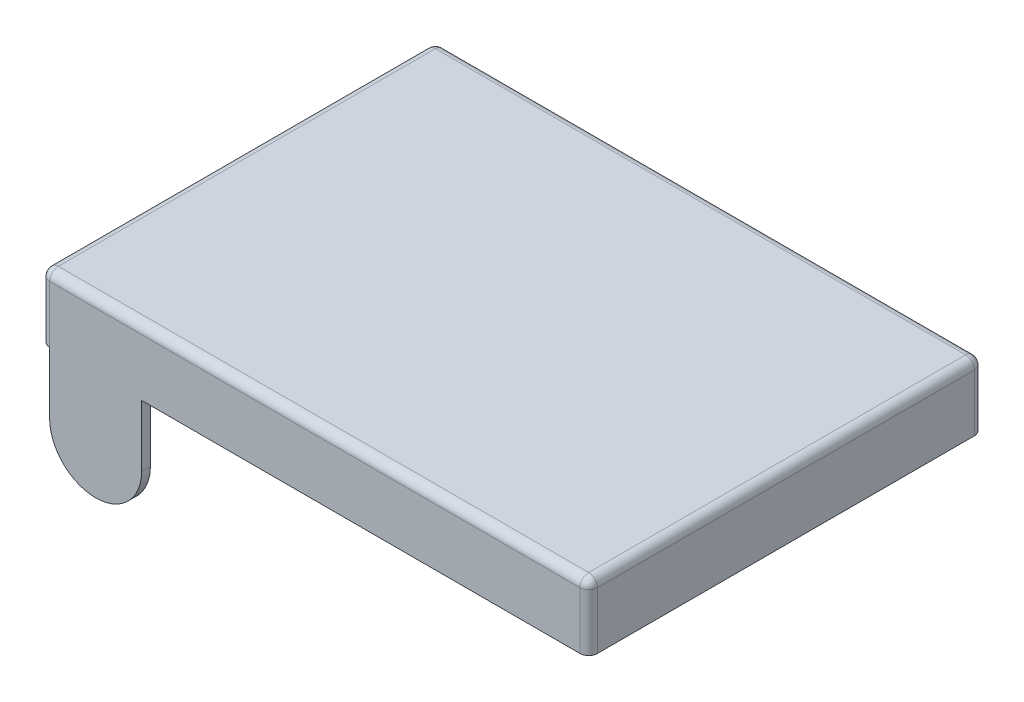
ISO-10303-21;
HEADER;
FILE_DESCRIPTION(('STEP AP214'),'2;1');
FILE_NAME('part.step','',(''),(''),'','','');
FILE_SCHEMA(('AUTOMOTIVE_DESIGN { 1 0 10303 214 1 1 1 1 }'));
ENDSEC;
DATA;
#1=APPLICATION_CONTEXT('core data for automotive mechanical design processes');
#2=APPLICATION_PROTOCOL_DEFINITION('international standard','automotive_design',2000,#1);
#3=PRODUCT_CONTEXT('',#1,'mechanical');
#4=PRODUCT('Part','Part','',(#3));
#5=PRODUCT_RELATED_PRODUCT_CATEGORY('part','',(#4));
#6=PRODUCT_DEFINITION_FORMATION('','',#4);
#7=PRODUCT_DEFINITION_CONTEXT('part definition',#1,'design');
#8=PRODUCT_DEFINITION('design','',#6,#7);
#9=PRODUCT_DEFINITION_SHAPE('','',#8);
#10=(LENGTH_UNIT() NAMED_UNIT(*) SI_UNIT(.MILLI.,.METRE.));
#11=(NAMED_UNIT(*) PLANE_ANGLE_UNIT() SI_UNIT($,.RADIAN.));
#12=(NAMED_UNIT(*) SI_UNIT($,.STERADIAN.) SOLID_ANGLE_UNIT());
#13=UNCERTAINTY_MEASURE_WITH_UNIT(LENGTH_MEASURE(1.E-05),#10,'distance_accuracy_value','');
#14=(GEOMETRIC_REPRESENTATION_CONTEXT(3) GLOBAL_UNCERTAINTY_ASSIGNED_CONTEXT((#13)) GLOBAL_UNIT_ASSIGNED_CONTEXT((#10,
#11,#12)) REPRESENTATION_CONTEXT('',''));
#15=CARTESIAN_POINT('',(0.,0.,0.));
#16=DIRECTION('',(0.,0.,1.));
#17=DIRECTION('',(1.,0.,0.));
#18=AXIS2_PLACEMENT_3D('',#15,#16,#17);
#19=CARTESIAN_POINT('',(62.5,0.,-45.));
#20=DIRECTION('',(0.,1.,0.));
#21=DIRECTION('',(0.,0.,1.));
#22=AXIS2_PLACEMENT_3D('',#19,#20,#21);
#23=PLANE('',#22);
#24=DIRECTION('',(0.,0.,-1.));
#25=VECTOR('',#24,1.);
#26=CARTESIAN_POINT('',(-60.5,0.,-43.));
#27=LINE('',#26,#25);
#28=CARTESIAN_POINT('',(-60.5,0.,-43.));
#29=VERTEX_POINT('',#28);
#30=CARTESIAN_POINT('',(-60.5,0.,-45.));
#31=VERTEX_POINT('',#30);
#32=EDGE_CURVE('E206',#29,#31,#27,.T.);
#33=ORIENTED_EDGE('',*,*,#32,.F.);
#34=DIRECTION('',(0.,0.,1.));
#35=VECTOR('',#34,1.);
#36=CARTESIAN_POINT('',(-60.5,0.,45.));
#37=LINE('',#36,#35);
#38=CARTESIAN_POINT('',(-60.5,0.,43.));
#39=VERTEX_POINT('',#38);
#40=EDGE_CURVE('E326',#29,#39,#37,.T.);
#41=ORIENTED_EDGE('',*,*,#40,.T.);
#42=DIRECTION('',(0.,0.,1.));
#43=VECTOR('',#42,1.);
#44=CARTESIAN_POINT('',(-60.5,0.,43.));
#45=LINE('',#44,#43);
#46=CARTESIAN_POINT('',(-60.5,0.,45.));
#47=VERTEX_POINT('',#46);
#48=EDGE_CURVE('E243',#39,#47,#45,.T.);
#49=ORIENTED_EDGE('',*,*,#48,.T.);
#50=CARTESIAN_POINT('',(-60.5,0.,43.));
#51=DIRECTION('',(0.,1.,0.));
#52=DIRECTION('',(0.,0.,1.));
#53=AXIS2_PLACEMENT_3D('',#50,#51,#52);
#54=CIRCLE('',#53,2.);
#55=CARTESIAN_POINT('',(-62.5,0.,43.));
#56=VERTEX_POINT('',#55);
#57=EDGE_CURVE('E283',#47,#56,#54,.F.);
#58=ORIENTED_EDGE('',*,*,#57,.T.);
#59=DIRECTION('',(0.,0.,1.));
#60=VECTOR('',#59,1.);
#61=CARTESIAN_POINT('',(-62.5,0.,45.));
#62=LINE('',#61,#60);
#63=CARTESIAN_POINT('',(-62.5,0.,-43.));
#64=VERTEX_POINT('',#63);
#65=EDGE_CURVE('E262',#64,#56,#62,.T.);
#66=ORIENTED_EDGE('',*,*,#65,.F.);
#67=CARTESIAN_POINT('',(-60.5,0.,-43.));
#68=DIRECTION('',(0.,1.,0.));
#69=DIRECTION('',(0.,0.,1.));
#70=AXIS2_PLACEMENT_3D('',#67,#68,#69);
#71=CIRCLE('',#70,2.);
#72=EDGE_CURVE('E285',#64,#31,#71,.F.);
#73=ORIENTED_EDGE('',*,*,#72,.T.);
#74=EDGE_LOOP('',(#33,#41,#49,#58,#66,#73));
#75=FACE_BOUND('',#74,.T.);
#76=ADVANCED_FACE('F32',(#75),#23,.F.);
#77=DIRECTION('',(0.,0.,-1.));
#78=VECTOR('',#77,1.);
#79=CARTESIAN_POINT('',(-39.5,0.,-43.));
#80=LINE('',#79,#78);
#81=CARTESIAN_POINT('',(-39.5,0.,-43.));
#82=VERTEX_POINT('',#81);
#83=CARTESIAN_POINT('',(-39.5,0.,-45.));
#84=VERTEX_POINT('',#83);
#85=EDGE_CURVE('E49',#82,#84,#80,.T.);
#86=ORIENTED_EDGE('',*,*,#85,.T.);
#87=DIRECTION('',(-1.,0.,0.));
#88=VECTOR('',#87,1.);
#89=CARTESIAN_POINT('',(-62.5,0.,-45.));
#90=LINE('',#89,#88);
#91=CARTESIAN_POINT('',(60.5,0.,-45.));
#92=VERTEX_POINT('',#91);
#93=EDGE_CURVE('E192',#92,#84,#90,.T.);
#94=ORIENTED_EDGE('',*,*,#93,.F.);
#95=CARTESIAN_POINT('',(60.5,0.,-43.));
#96=DIRECTION('',(0.,1.,0.));
#97=DIRECTION('',(0.,0.,1.));
#98=AXIS2_PLACEMENT_3D('',#95,#96,#97);
#99=CIRCLE('',#98,2.);
#100=CARTESIAN_POINT('',(62.5,0.,-43.));
#101=VERTEX_POINT('',#100);
#102=EDGE_CURVE('E281',#92,#101,#99,.F.);
#103=ORIENTED_EDGE('',*,*,#102,.T.);
#104=DIRECTION('',(0.,0.,-1.));
#105=VECTOR('',#104,1.);
#106=CARTESIAN_POINT('',(62.5,0.,45.));
#107=LINE('',#106,#105);
#108=CARTESIAN_POINT('',(62.5,0.,43.));
#109=VERTEX_POINT('',#108);
#110=EDGE_CURVE('E261',#109,#101,#107,.T.);
#111=ORIENTED_EDGE('',*,*,#110,.F.);
#112=CARTESIAN_POINT('',(60.5,0.,43.));
#113=DIRECTION('',(0.,1.,0.));
#114=DIRECTION('',(0.,0.,1.));
#115=AXIS2_PLACEMENT_3D('',#112,#113,#114);
#116=CIRCLE('',#115,2.);
#117=CARTESIAN_POINT('',(60.5,0.,45.));
#118=VERTEX_POINT('',#117);
#119=EDGE_CURVE('E259',#109,#118,#116,.F.);
#120=ORIENTED_EDGE('',*,*,#119,.T.);
#121=DIRECTION('',(1.,0.,0.));
#122=VECTOR('',#121,1.);
#123=CARTESIAN_POINT('',(-62.5,0.,45.));
#124=LINE('',#123,#122);
#125=CARTESIAN_POINT('',(-39.5,0.,45.));
#126=VERTEX_POINT('',#125);
#127=EDGE_CURVE('E239',#126,#118,#124,.T.);
#128=ORIENTED_EDGE('',*,*,#127,.F.);
#129=DIRECTION('',(0.,0.,1.));
#130=VECTOR('',#129,1.);
#131=CARTESIAN_POINT('',(-39.5,0.,43.));
#132=LINE('',#131,#130);
#133=CARTESIAN_POINT('',(-39.5,0.,43.));
#134=VERTEX_POINT('',#133);
#135=EDGE_CURVE('E236',#134,#126,#132,.T.);
#136=ORIENTED_EDGE('',*,*,#135,.F.);
#137=DIRECTION('',(1.,0.,0.));
#138=VECTOR('',#137,1.);
#139=CARTESIAN_POINT('',(-62.5,0.,43.));
#140=LINE('',#139,#138);
#141=CARTESIAN_POINT('',(60.5,0.,43.));
#142=VERTEX_POINT('',#141);
#143=EDGE_CURVE('E323',#134,#142,#140,.T.);
#144=ORIENTED_EDGE('',*,*,#143,.T.);
#145=DIRECTION('',(0.,0.,-1.));
#146=VECTOR('',#145,1.);
#147=CARTESIAN_POINT('',(60.5,0.,45.));
#148=LINE('',#147,#146);
#149=CARTESIAN_POINT('',(60.5,0.,-43.));
#150=VERTEX_POINT('',#149);
#151=EDGE_CURVE('E325',#142,#150,#148,.T.);
#152=ORIENTED_EDGE('',*,*,#151,.T.);
#153=DIRECTION('',(-1.,0.,0.));
#154=VECTOR('',#153,1.);
#155=CARTESIAN_POINT('',(-62.5,0.,-43.));
#156=LINE('',#155,#154);
#157=EDGE_CURVE('E54',#150,#82,#156,.T.);
#158=ORIENTED_EDGE('',*,*,#157,.T.);
#159=EDGE_LOOP('',(#86,#94,#103,#111,#120,#128,#136,#144,#152,#158));
#160=FACE_BOUND('',#159,.T.);
#161=ADVANCED_FACE('F255',(#160),#23,.F.);
#162=CARTESIAN_POINT('',(-62.5,15.,-45.));
#163=DIRECTION('',(0.,0.,1.));
#164=DIRECTION('',(1.,0.,0.));
#165=AXIS2_PLACEMENT_3D('',#162,#163,#164);
#166=PLANE('',#165);
#167=DIRECTION('',(0.,-1.,0.));
#168=VECTOR('',#167,1.);
#169=CARTESIAN_POINT('',(-60.5,15.,-45.));
#170=LINE('',#169,#168);
#171=CARTESIAN_POINT('',(-60.5,13.,-45.));
#172=VERTEX_POINT('',#171);
#173=EDGE_CURVE('E289',#31,#172,#170,.F.);
#174=ORIENTED_EDGE('',*,*,#173,.T.);
#175=DIRECTION('',(-1.,0.,0.));
#176=VECTOR('',#175,1.);
#177=CARTESIAN_POINT('',(60.5,13.,-45.));
#178=LINE('',#177,#176);
#179=CARTESIAN_POINT('',(60.5,13.,-45.));
#180=VERTEX_POINT('',#179);
#181=EDGE_CURVE('E317',#172,#180,#178,.F.);
#182=ORIENTED_EDGE('',*,*,#181,.T.);
#183=DIRECTION('',(0.,-1.,0.));
#184=VECTOR('',#183,1.);
#185=CARTESIAN_POINT('',(60.5,15.,-45.));
#186=LINE('',#185,#184);
#187=EDGE_CURVE('E287',#180,#92,#186,.T.);
#188=ORIENTED_EDGE('',*,*,#187,.T.);
#189=ORIENTED_EDGE('',*,*,#93,.T.);
#190=DIRECTION('',(0.,1.,0.));
#191=VECTOR('',#190,1.);
#192=CARTESIAN_POINT('',(-39.5,-14.,-45.));
#193=LINE('',#192,#191);
#194=CARTESIAN_POINT('',(-39.5,-14.,-45.));
#195=VERTEX_POINT('',#194);
#196=EDGE_CURVE('E184',#195,#84,#193,.T.);
#197=ORIENTED_EDGE('',*,*,#196,.F.);
#198=CARTESIAN_POINT('',(-50.,-14.,-45.));
#199=DIRECTION('',(0.,0.,1.));
#200=DIRECTION('',(1.,0.,0.));
#201=AXIS2_PLACEMENT_3D('',#198,#199,#200);
#202=CIRCLE('',#201,10.5);
#203=CARTESIAN_POINT('',(-60.5,-14.,-45.));
#204=VERTEX_POINT('',#203);
#205=EDGE_CURVE('E172',#204,#195,#202,.T.);
#206=ORIENTED_EDGE('',*,*,#205,.F.);
#207=DIRECTION('',(0.,-1.,0.));
#208=VECTOR('',#207,1.);
#209=CARTESIAN_POINT('',(-60.5,0.,-45.));
#210=LINE('',#209,#208);
#211=EDGE_CURVE('E183',#31,#204,#210,.T.);
#212=ORIENTED_EDGE('',*,*,#211,.F.);
#213=EDGE_LOOP('',(#174,#182,#188,#189,#197,#206,#212));
#214=FACE_BOUND('',#213,.T.);
#215=ADVANCED_FACE('F34',(#214),#166,.F.);
#216=CARTESIAN_POINT('',(-62.5,15.,45.));
#217=DIRECTION('',(1.,0.,0.));
#218=DIRECTION('',(0.,0.,-1.));
#219=AXIS2_PLACEMENT_3D('',#216,#217,#218);
#220=PLANE('',#219);
#221=DIRECTION('',(0.,-1.,0.));
#222=VECTOR('',#221,1.);
#223=CARTESIAN_POINT('',(-62.5,15.,43.));
#224=LINE('',#223,#222);
#225=CARTESIAN_POINT('',(-62.5,13.,43.));
#226=VERTEX_POINT('',#225);
#227=EDGE_CURVE('E264',#56,#226,#224,.F.);
#228=ORIENTED_EDGE('',*,*,#227,.T.);
#229=DIRECTION('',(0.,0.,1.));
#230=VECTOR('',#229,1.);
#231=CARTESIAN_POINT('',(-62.5,13.,-43.));
#232=LINE('',#231,#230);
#233=CARTESIAN_POINT('',(-62.5,13.,-43.));
#234=VERTEX_POINT('',#233);
#235=EDGE_CURVE('E313',#226,#234,#232,.F.);
#236=ORIENTED_EDGE('',*,*,#235,.T.);
#237=DIRECTION('',(0.,-1.,0.));
#238=VECTOR('',#237,1.);
#239=CARTESIAN_POINT('',(-62.5,15.,-43.));
#240=LINE('',#239,#238);
#241=EDGE_CURVE('E278',#234,#64,#240,.T.);
#242=ORIENTED_EDGE('',*,*,#241,.T.);
#243=ORIENTED_EDGE('',*,*,#65,.T.);
#244=EDGE_LOOP('',(#228,#236,#242,#243));
#245=FACE_BOUND('',#244,.T.);
#246=ADVANCED_FACE('F398',(#245),#220,.F.);
#247=CARTESIAN_POINT('',(-62.5,15.,45.));
#248=DIRECTION('',(0.,0.,-1.));
#249=DIRECTION('',(-1.,0.,0.));
#250=AXIS2_PLACEMENT_3D('',#247,#248,#249);
#251=PLANE('',#250);
#252=DIRECTION('',(0.,-1.,0.));
#253=VECTOR('',#252,1.);
#254=CARTESIAN_POINT('',(60.5,15.,45.));
#255=LINE('',#254,#253);
#256=CARTESIAN_POINT('',(60.5,13.,45.));
#257=VERTEX_POINT('',#256);
#258=EDGE_CURVE('E291',#118,#257,#255,.F.);
#259=ORIENTED_EDGE('',*,*,#258,.T.);
#260=DIRECTION('',(1.,0.,0.));
#261=VECTOR('',#260,1.);
#262=CARTESIAN_POINT('',(-60.5,13.,45.));
#263=LINE('',#262,#261);
#264=CARTESIAN_POINT('',(-60.5,13.,45.));
#265=VERTEX_POINT('',#264);
#266=EDGE_CURVE('E11',#257,#265,#263,.F.);
#267=ORIENTED_EDGE('',*,*,#266,.T.);
#268=DIRECTION('',(0.,-1.,0.));
#269=VECTOR('',#268,1.);
#270=CARTESIAN_POINT('',(-60.5,15.,45.));
#271=LINE('',#270,#269);
#272=EDGE_CURVE('E293',#265,#47,#271,.T.);
#273=ORIENTED_EDGE('',*,*,#272,.T.);
#274=DIRECTION('',(0.,-1.,0.));
#275=VECTOR('',#274,1.);
#276=CARTESIAN_POINT('',(-60.5,0.,45.));
#277=LINE('',#276,#275);
#278=CARTESIAN_POINT('',(-60.5,-14.,45.));
#279=VERTEX_POINT('',#278);
#280=EDGE_CURVE('E217',#47,#279,#277,.T.);
#281=ORIENTED_EDGE('',*,*,#280,.T.);
#282=CARTESIAN_POINT('',(-50.,-14.,45.));
#283=DIRECTION('',(0.,0.,1.));
#284=DIRECTION('',(1.,0.,0.));
#285=AXIS2_PLACEMENT_3D('',#282,#283,#284);
#286=CIRCLE('',#285,10.5);
#287=CARTESIAN_POINT('',(-39.5,-14.,45.));
#288=VERTEX_POINT('',#287);
#289=EDGE_CURVE('E220',#279,#288,#286,.T.);
#290=ORIENTED_EDGE('',*,*,#289,.T.);
#291=DIRECTION('',(0.,1.,0.));
#292=VECTOR('',#291,1.);
#293=CARTESIAN_POINT('',(-39.5,-14.,45.));
#294=LINE('',#293,#292);
#295=EDGE_CURVE('E223',#288,#126,#294,.T.);
#296=ORIENTED_EDGE('',*,*,#295,.T.);
#297=ORIENTED_EDGE('',*,*,#127,.T.);
#298=EDGE_LOOP('',(#259,#267,#273,#281,#290,#296,#297));
#299=FACE_BOUND('',#298,.T.);
#300=ADVANCED_FACE('F250',(#299),#251,.F.);
#301=CARTESIAN_POINT('',(62.5,15.,45.));
#302=DIRECTION('',(-1.,0.,0.));
#303=DIRECTION('',(0.,0.,1.));
#304=AXIS2_PLACEMENT_3D('',#301,#302,#303);
#305=PLANE('',#304);
#306=DIRECTION('',(0.,-1.,0.));
#307=VECTOR('',#306,1.);
#308=CARTESIAN_POINT('',(62.5,15.,-43.));
#309=LINE('',#308,#307);
#310=CARTESIAN_POINT('',(62.5,13.,-43.));
#311=VERTEX_POINT('',#310);
#312=EDGE_CURVE('E298',#101,#311,#309,.F.);
#313=ORIENTED_EDGE('',*,*,#312,.T.);
#314=DIRECTION('',(0.,0.,-1.));
#315=VECTOR('',#314,1.);
#316=CARTESIAN_POINT('',(62.5,13.,43.));
#317=LINE('',#316,#315);
#318=CARTESIAN_POINT('',(62.5,13.,43.));
#319=VERTEX_POINT('',#318);
#320=EDGE_CURVE('E321',#311,#319,#317,.F.);
#321=ORIENTED_EDGE('',*,*,#320,.T.);
#322=DIRECTION('',(0.,-1.,0.));
#323=VECTOR('',#322,1.);
#324=CARTESIAN_POINT('',(62.5,15.,43.));
#325=LINE('',#324,#323);
#326=EDGE_CURVE('E296',#319,#109,#325,.T.);
#327=ORIENTED_EDGE('',*,*,#326,.T.);
#328=ORIENTED_EDGE('',*,*,#110,.T.);
#329=EDGE_LOOP('',(#313,#321,#327,#328));
#330=FACE_BOUND('',#329,.T.);
#331=ADVANCED_FACE('F370',(#330),#305,.F.);
#332=CARTESIAN_POINT('',(62.5,15.,-45.));
#333=DIRECTION('',(0.,1.,0.));
#334=DIRECTION('',(0.,0.,1.));
#335=AXIS2_PLACEMENT_3D('',#332,#333,#334);
#336=PLANE('',#335);
#337=DIRECTION('',(-1.,0.,0.));
#338=VECTOR('',#337,1.);
#339=CARTESIAN_POINT('',(-60.5,15.,-43.));
#340=LINE('',#339,#338);
#341=CARTESIAN_POINT('',(60.5,15.,-43.));
#342=VERTEX_POINT('',#341);
#343=CARTESIAN_POINT('',(-60.5,15.,-43.));
#344=VERTEX_POINT('',#343);
#345=EDGE_CURVE('E308',#342,#344,#340,.T.);
#346=ORIENTED_EDGE('',*,*,#345,.T.);
#347=DIRECTION('',(0.,0.,1.));
#348=VECTOR('',#347,1.);
#349=CARTESIAN_POINT('',(-60.5,15.,43.));
#350=LINE('',#349,#348);
#351=CARTESIAN_POINT('',(-60.5,15.,43.));
#352=VERTEX_POINT('',#351);
#353=EDGE_CURVE('E310',#344,#352,#350,.T.);
#354=ORIENTED_EDGE('',*,*,#353,.T.);
#355=DIRECTION('',(1.,0.,0.));
#356=VECTOR('',#355,1.);
#357=CARTESIAN_POINT('',(60.5,15.,43.));
#358=LINE('',#357,#356);
#359=CARTESIAN_POINT('',(60.5,15.,43.));
#360=VERTEX_POINT('',#359);
#361=EDGE_CURVE('E304',#352,#360,#358,.T.);
#362=ORIENTED_EDGE('',*,*,#361,.T.);
#363=DIRECTION('',(0.,0.,-1.));
#364=VECTOR('',#363,1.);
#365=CARTESIAN_POINT('',(60.5,15.,-43.));
#366=LINE('',#365,#364);
#367=EDGE_CURVE('E306',#360,#342,#366,.T.);
#368=ORIENTED_EDGE('',*,*,#367,.T.);
#369=EDGE_LOOP('',(#346,#354,#362,#368));
#370=FACE_BOUND('',#369,.T.);
#371=ADVANCED_FACE('F416',(#370),#336,.T.);
#372=CARTESIAN_POINT('',(-60.5,15.,-43.));
#373=DIRECTION('',(0.,-1.,0.));
#374=DIRECTION('',(0.,0.,-1.));
#375=AXIS2_PLACEMENT_3D('',#372,#373,#374);
#376=CYLINDRICAL_SURFACE('',#375,2.);
#377=ORIENTED_EDGE('',*,*,#241,.F.);
#378=CARTESIAN_POINT('',(-60.5,13.,-43.));
#379=DIRECTION('',(0.,-1.,0.));
#380=DIRECTION('',(0.,0.,-1.));
#381=AXIS2_PLACEMENT_3D('',#378,#379,#380);
#382=CIRCLE('',#381,2.);
#383=EDGE_CURVE('E315',#234,#172,#382,.T.);
#384=ORIENTED_EDGE('',*,*,#383,.T.);
#385=ORIENTED_EDGE('',*,*,#173,.F.);
#386=ORIENTED_EDGE('',*,*,#72,.F.);
#387=EDGE_LOOP('',(#377,#384,#385,#386));
#388=FACE_BOUND('',#387,.T.);
#389=ADVANCED_FACE('F414',(#388),#376,.T.);
#390=CARTESIAN_POINT('',(-60.5,15.,43.));
#391=DIRECTION('',(0.,-1.,0.));
#392=DIRECTION('',(0.,0.,-1.));
#393=AXIS2_PLACEMENT_3D('',#390,#391,#392);
#394=CYLINDRICAL_SURFACE('',#393,2.);
#395=ORIENTED_EDGE('',*,*,#272,.F.);
#396=CARTESIAN_POINT('',(-60.5,13.,43.));
#397=DIRECTION('',(0.,-1.,0.));
#398=DIRECTION('',(0.,0.,-1.));
#399=AXIS2_PLACEMENT_3D('',#396,#397,#398);
#400=CIRCLE('',#399,2.);
#401=EDGE_CURVE('E301',#265,#226,#400,.T.);
#402=ORIENTED_EDGE('',*,*,#401,.T.);
#403=ORIENTED_EDGE('',*,*,#227,.F.);
#404=ORIENTED_EDGE('',*,*,#57,.F.);
#405=EDGE_LOOP('',(#395,#402,#403,#404));
#406=FACE_BOUND('',#405,.T.);
#407=ADVANCED_FACE('F396',(#406),#394,.T.);
#408=CARTESIAN_POINT('',(60.5,15.,-43.));
#409=DIRECTION('',(0.,-1.,0.));
#410=DIRECTION('',(0.,0.,-1.));
#411=AXIS2_PLACEMENT_3D('',#408,#409,#410);
#412=CYLINDRICAL_SURFACE('',#411,2.);
#413=ORIENTED_EDGE('',*,*,#187,.F.);
#414=CARTESIAN_POINT('',(60.5,13.,-43.));
#415=DIRECTION('',(0.,-1.,0.));
#416=DIRECTION('',(0.,0.,-1.));
#417=AXIS2_PLACEMENT_3D('',#414,#415,#416);
#418=CIRCLE('',#417,2.);
#419=EDGE_CURVE('E319',#180,#311,#418,.T.);
#420=ORIENTED_EDGE('',*,*,#419,.T.);
#421=ORIENTED_EDGE('',*,*,#312,.F.);
#422=ORIENTED_EDGE('',*,*,#102,.F.);
#423=EDGE_LOOP('',(#413,#420,#421,#422));
#424=FACE_BOUND('',#423,.T.);
#425=ADVANCED_FACE('F367',(#424),#412,.T.);
#426=CARTESIAN_POINT('',(60.5,15.,43.));
#427=DIRECTION('',(0.,-1.,0.));
#428=DIRECTION('',(0.,0.,-1.));
#429=AXIS2_PLACEMENT_3D('',#426,#427,#428);
#430=CYLINDRICAL_SURFACE('',#429,2.);
#431=ORIENTED_EDGE('',*,*,#326,.F.);
#432=CARTESIAN_POINT('',(60.5,13.,43.));
#433=DIRECTION('',(0.,-1.,0.));
#434=DIRECTION('',(0.,0.,-1.));
#435=AXIS2_PLACEMENT_3D('',#432,#433,#434);
#436=CIRCLE('',#435,2.);
#437=EDGE_CURVE('E41',#319,#257,#436,.T.);
#438=ORIENTED_EDGE('',*,*,#437,.T.);
#439=ORIENTED_EDGE('',*,*,#258,.F.);
#440=ORIENTED_EDGE('',*,*,#119,.F.);
#441=EDGE_LOOP('',(#431,#438,#439,#440));
#442=FACE_BOUND('',#441,.T.);
#443=ADVANCED_FACE('F374',(#442),#430,.T.);
#444=CARTESIAN_POINT('',(60.5,13.,-43.));
#445=DIRECTION('',(0.,0.,1.));
#446=DIRECTION('',(1.,0.,0.));
#447=AXIS2_PLACEMENT_3D('',#444,#445,#446);
#448=SPHERICAL_SURFACE('',#447,2.);
#449=CARTESIAN_POINT('',(60.5,13.,-43.));
#450=DIRECTION('',(0.,0.,1.));
#451=DIRECTION('',(1.,0.,0.));
#452=AXIS2_PLACEMENT_3D('',#449,#450,#451);
#453=CIRCLE('',#452,2.);
#454=EDGE_CURVE('E350',#311,#342,#453,.T.);
#455=ORIENTED_EDGE('',*,*,#454,.F.);
#456=ORIENTED_EDGE('',*,*,#419,.F.);
#457=CARTESIAN_POINT('',(60.5,13.,-43.));
#458=DIRECTION('',(-1.,0.,0.));
#459=DIRECTION('',(0.,0.,1.));
#460=AXIS2_PLACEMENT_3D('',#457,#458,#459);
#461=CIRCLE('',#460,2.);
#462=EDGE_CURVE('E272',#342,#180,#461,.T.);
#463=ORIENTED_EDGE('',*,*,#462,.F.);
#464=EDGE_LOOP('',(#455,#456,#463));
#465=FACE_BOUND('',#464,.T.);
#466=ADVANCED_FACE('F362',(#465),#448,.T.);
#467=CARTESIAN_POINT('',(62.5,13.,-43.));
#468=DIRECTION('',(1.,0.,0.));
#469=DIRECTION('',(0.,0.,-1.));
#470=AXIS2_PLACEMENT_3D('',#467,#468,#469);
#471=CYLINDRICAL_SURFACE('',#470,2.);
#472=ORIENTED_EDGE('',*,*,#462,.T.);
#473=ORIENTED_EDGE('',*,*,#181,.F.);
#474=CARTESIAN_POINT('',(-60.5,13.,-43.));
#475=DIRECTION('',(-1.,0.,0.));
#476=DIRECTION('',(0.,0.,1.));
#477=AXIS2_PLACEMENT_3D('',#474,#475,#476);
#478=CIRCLE('',#477,2.);
#479=EDGE_CURVE('E347',#344,#172,#478,.T.);
#480=ORIENTED_EDGE('',*,*,#479,.F.);
#481=ORIENTED_EDGE('',*,*,#345,.F.);
#482=EDGE_LOOP('',(#472,#473,#480,#481));
#483=FACE_BOUND('',#482,.T.);
#484=ADVANCED_FACE('F357',(#483),#471,.T.);
#485=CARTESIAN_POINT('',(60.5,13.,-45.));
#486=DIRECTION('',(0.,0.,1.));
#487=DIRECTION('',(1.,0.,0.));
#488=AXIS2_PLACEMENT_3D('',#485,#486,#487);
#489=CYLINDRICAL_SURFACE('',#488,2.);
#490=ORIENTED_EDGE('',*,*,#454,.T.);
#491=ORIENTED_EDGE('',*,*,#367,.F.);
#492=CARTESIAN_POINT('',(60.5,13.,43.));
#493=DIRECTION('',(0.,0.,1.));
#494=DIRECTION('',(1.,0.,0.));
#495=AXIS2_PLACEMENT_3D('',#492,#493,#494);
#496=CIRCLE('',#495,2.);
#497=EDGE_CURVE('E344',#319,#360,#496,.T.);
#498=ORIENTED_EDGE('',*,*,#497,.F.);
#499=ORIENTED_EDGE('',*,*,#320,.F.);
#500=EDGE_LOOP('',(#490,#491,#498,#499));
#501=FACE_BOUND('',#500,.T.);
#502=ADVANCED_FACE('F467',(#501),#489,.T.);
#503=CARTESIAN_POINT('',(-60.5,13.,-43.));
#504=DIRECTION('',(0.,0.,1.));
#505=DIRECTION('',(1.,0.,0.));
#506=AXIS2_PLACEMENT_3D('',#503,#504,#505);
#507=SPHERICAL_SURFACE('',#506,2.);
#508=ORIENTED_EDGE('',*,*,#479,.T.);
#509=ORIENTED_EDGE('',*,*,#383,.F.);
#510=CARTESIAN_POINT('',(-60.5,13.,-43.));
#511=DIRECTION('',(0.,0.,1.));
#512=DIRECTION('',(1.,0.,0.));
#513=AXIS2_PLACEMENT_3D('',#510,#511,#512);
#514=CIRCLE('',#513,2.);
#515=EDGE_CURVE('E341',#344,#234,#514,.T.);
#516=ORIENTED_EDGE('',*,*,#515,.F.);
#517=EDGE_LOOP('',(#508,#509,#516));
#518=FACE_BOUND('',#517,.T.);
#519=ADVANCED_FACE('F474',(#518),#507,.T.);
#520=CARTESIAN_POINT('',(60.5,13.,43.));
#521=DIRECTION('',(0.,0.,1.));
#522=DIRECTION('',(1.,0.,0.));
#523=AXIS2_PLACEMENT_3D('',#520,#521,#522);
#524=SPHERICAL_SURFACE('',#523,2.);
#525=ORIENTED_EDGE('',*,*,#437,.F.);
#526=ORIENTED_EDGE('',*,*,#497,.T.);
#527=CARTESIAN_POINT('',(60.5,13.,43.));
#528=DIRECTION('',(-1.,0.,0.));
#529=DIRECTION('',(0.,0.,1.));
#530=AXIS2_PLACEMENT_3D('',#527,#528,#529);
#531=CIRCLE('',#530,2.);
#532=EDGE_CURVE('E338',#257,#360,#531,.T.);
#533=ORIENTED_EDGE('',*,*,#532,.F.);
#534=EDGE_LOOP('',(#525,#526,#533));
#535=FACE_BOUND('',#534,.T.);
#536=ADVANCED_FACE('F380',(#535),#524,.T.);
#537=CARTESIAN_POINT('',(-60.5,13.,-45.));
#538=DIRECTION('',(0.,0.,-1.));
#539=DIRECTION('',(-1.,0.,0.));
#540=AXIS2_PLACEMENT_3D('',#537,#538,#539);
#541=CYLINDRICAL_SURFACE('',#540,2.);
#542=ORIENTED_EDGE('',*,*,#515,.T.);
#543=ORIENTED_EDGE('',*,*,#235,.F.);
#544=CARTESIAN_POINT('',(-60.5,13.,43.));
#545=DIRECTION('',(0.,0.,1.));
#546=DIRECTION('',(1.,0.,0.));
#547=AXIS2_PLACEMENT_3D('',#544,#545,#546);
#548=CIRCLE('',#547,2.);
#549=EDGE_CURVE('E335',#352,#226,#548,.T.);
#550=ORIENTED_EDGE('',*,*,#549,.F.);
#551=ORIENTED_EDGE('',*,*,#353,.F.);
#552=EDGE_LOOP('',(#542,#543,#550,#551));
#553=FACE_BOUND('',#552,.T.);
#554=ADVANCED_FACE('F392',(#553),#541,.T.);
#555=CARTESIAN_POINT('',(62.5,13.,43.));
#556=DIRECTION('',(-1.,0.,0.));
#557=DIRECTION('',(0.,0.,1.));
#558=AXIS2_PLACEMENT_3D('',#555,#556,#557);
#559=CYLINDRICAL_SURFACE('',#558,2.);
#560=ORIENTED_EDGE('',*,*,#532,.T.);
#561=ORIENTED_EDGE('',*,*,#361,.F.);
#562=CARTESIAN_POINT('',(-60.5,13.,43.));
#563=DIRECTION('',(-1.,0.,0.));
#564=DIRECTION('',(0.,0.,1.));
#565=AXIS2_PLACEMENT_3D('',#562,#563,#564);
#566=CIRCLE('',#565,2.);
#567=EDGE_CURVE('E333',#265,#352,#566,.T.);
#568=ORIENTED_EDGE('',*,*,#567,.F.);
#569=ORIENTED_EDGE('',*,*,#266,.F.);
#570=EDGE_LOOP('',(#560,#561,#568,#569));
#571=FACE_BOUND('',#570,.T.);
#572=ADVANCED_FACE('F384',(#571),#559,.T.);
#573=CARTESIAN_POINT('',(-60.5,13.,43.));
#574=DIRECTION('',(0.,0.,1.));
#575=DIRECTION('',(1.,0.,0.));
#576=AXIS2_PLACEMENT_3D('',#573,#574,#575);
#577=SPHERICAL_SURFACE('',#576,2.);
#578=ORIENTED_EDGE('',*,*,#549,.T.);
#579=ORIENTED_EDGE('',*,*,#401,.F.);
#580=ORIENTED_EDGE('',*,*,#567,.T.);
#581=EDGE_LOOP('',(#578,#579,#580));
#582=FACE_BOUND('',#581,.T.);
#583=ADVANCED_FACE('F388',(#582),#577,.T.);
#584=CARTESIAN_POINT('',(-62.5,15.,-43.));
#585=DIRECTION('',(0.,0.,1.));
#586=DIRECTION('',(1.,0.,0.));
#587=AXIS2_PLACEMENT_3D('',#584,#585,#586);
#588=PLANE('',#587);
#589=CARTESIAN_POINT('',(-50.,-14.,-43.));
#590=DIRECTION('',(0.,0.,1.));
#591=DIRECTION('',(1.,0.,0.));
#592=AXIS2_PLACEMENT_3D('',#589,#590,#591);
#593=CIRCLE('',#592,1.25000000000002);
#594=CARTESIAN_POINT('',(-48.75,-14.,-43.));
#595=VERTEX_POINT('',#594);
#596=EDGE_CURVE('E196',#595,#595,#593,.T.);
#597=ORIENTED_EDGE('',*,*,#596,.F.);
#598=EDGE_LOOP('',(#597));
#599=FACE_BOUND('',#598,.T.);
#600=DIRECTION('',(0.,1.,0.));
#601=VECTOR('',#600,1.);
#602=CARTESIAN_POINT('',(-60.5,15.,-43.));
#603=LINE('',#602,#601);
#604=CARTESIAN_POINT('',(-60.5,13.,-43.));
#605=VERTEX_POINT('',#604);
#606=EDGE_CURVE('E722',#29,#605,#603,.T.);
#607=ORIENTED_EDGE('',*,*,#606,.F.);
#608=DIRECTION('',(0.,-1.,0.));
#609=VECTOR('',#608,1.);
#610=CARTESIAN_POINT('',(-60.5,0.,-43.));
#611=LINE('',#610,#609);
#612=CARTESIAN_POINT('',(-60.5,-14.,-43.));
#613=VERTEX_POINT('',#612);
#614=EDGE_CURVE('E204',#29,#613,#611,.T.);
#615=ORIENTED_EDGE('',*,*,#614,.T.);
#616=CARTESIAN_POINT('',(-50.,-14.,-43.));
#617=DIRECTION('',(0.,0.,1.));
#618=DIRECTION('',(1.,0.,0.));
#619=AXIS2_PLACEMENT_3D('',#616,#617,#618);
#620=CIRCLE('',#619,10.5);
#621=CARTESIAN_POINT('',(-39.5,-14.,-43.));
#622=VERTEX_POINT('',#621);
#623=EDGE_CURVE('E202',#613,#622,#620,.T.);
#624=ORIENTED_EDGE('',*,*,#623,.T.);
#625=DIRECTION('',(0.,1.,0.));
#626=VECTOR('',#625,1.);
#627=CARTESIAN_POINT('',(-39.5,-14.,-43.));
#628=LINE('',#627,#626);
#629=EDGE_CURVE('E189',#622,#82,#628,.T.);
#630=ORIENTED_EDGE('',*,*,#629,.T.);
#631=ORIENTED_EDGE('',*,*,#157,.F.);
#632=DIRECTION('',(0.,1.,0.));
#633=VECTOR('',#632,1.);
#634=CARTESIAN_POINT('',(60.5,15.,-43.));
#635=LINE('',#634,#633);
#636=CARTESIAN_POINT('',(60.5,13.,-43.));
#637=VERTEX_POINT('',#636);
#638=EDGE_CURVE('E733',#150,#637,#635,.T.);
#639=ORIENTED_EDGE('',*,*,#638,.T.);
#640=DIRECTION('',(1.,0.,0.));
#641=VECTOR('',#640,1.);
#642=CARTESIAN_POINT('',(62.5,13.,-43.));
#643=LINE('',#642,#641);
#644=EDGE_CURVE('E336',#605,#637,#643,.T.);
#645=ORIENTED_EDGE('',*,*,#644,.F.);
#646=EDGE_LOOP('',(#607,#615,#624,#630,#631,#639,#645));
#647=FACE_BOUND('',#646,.T.);
#648=ADVANCED_FACE('F507',(#599,#647),#588,.T.);
#649=CARTESIAN_POINT('',(-60.5,15.,45.));
#650=DIRECTION('',(1.,0.,0.));
#651=DIRECTION('',(0.,0.,-1.));
#652=AXIS2_PLACEMENT_3D('',#649,#650,#651);
#653=PLANE('',#652);
#654=DIRECTION('',(0.,1.,0.));
#655=VECTOR('',#654,1.);
#656=CARTESIAN_POINT('',(-60.5,15.,43.));
#657=LINE('',#656,#655);
#658=CARTESIAN_POINT('',(-60.5,13.,43.));
#659=VERTEX_POINT('',#658);
#660=EDGE_CURVE('E728',#39,#659,#657,.T.);
#661=ORIENTED_EDGE('',*,*,#660,.F.);
#662=ORIENTED_EDGE('',*,*,#40,.F.);
#663=ORIENTED_EDGE('',*,*,#606,.T.);
#664=DIRECTION('',(0.,0.,-1.));
#665=VECTOR('',#664,1.);
#666=CARTESIAN_POINT('',(-60.5,13.,-45.));
#667=LINE('',#666,#665);
#668=EDGE_CURVE('E746',#659,#605,#667,.T.);
#669=ORIENTED_EDGE('',*,*,#668,.F.);
#670=EDGE_LOOP('',(#661,#662,#663,#669));
#671=FACE_BOUND('',#670,.T.);
#672=ADVANCED_FACE('F514',(#671),#653,.T.);
#673=CARTESIAN_POINT('',(-62.5,15.,43.));
#674=DIRECTION('',(0.,0.,-1.));
#675=DIRECTION('',(-1.,0.,0.));
#676=AXIS2_PLACEMENT_3D('',#673,#674,#675);
#677=PLANE('',#676);
#678=CARTESIAN_POINT('',(-50.,-14.,43.));
#679=DIRECTION('',(0.,0.,-1.));
#680=DIRECTION('',(-1.,0.,0.));
#681=AXIS2_PLACEMENT_3D('',#678,#679,#680);
#682=CIRCLE('',#681,1.25000000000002);
#683=CARTESIAN_POINT('',(-51.25,-14.,43.));
#684=VERTEX_POINT('',#683);
#685=EDGE_CURVE('E209',#684,#684,#682,.T.);
#686=ORIENTED_EDGE('',*,*,#685,.F.);
#687=EDGE_LOOP('',(#686));
#688=FACE_BOUND('',#687,.T.);
#689=DIRECTION('',(0.,1.,0.));
#690=VECTOR('',#689,1.);
#691=CARTESIAN_POINT('',(60.5,15.,43.));
#692=LINE('',#691,#690);
#693=CARTESIAN_POINT('',(60.5,13.,43.));
#694=VERTEX_POINT('',#693);
#695=EDGE_CURVE('E727',#142,#694,#692,.T.);
#696=ORIENTED_EDGE('',*,*,#695,.F.);
#697=ORIENTED_EDGE('',*,*,#143,.F.);
#698=DIRECTION('',(0.,1.,0.));
#699=VECTOR('',#698,1.);
#700=CARTESIAN_POINT('',(-39.5,-14.,43.));
#701=LINE('',#700,#699);
#702=CARTESIAN_POINT('',(-39.5,-14.,43.));
#703=VERTEX_POINT('',#702);
#704=EDGE_CURVE('E230',#703,#134,#701,.T.);
#705=ORIENTED_EDGE('',*,*,#704,.F.);
#706=CARTESIAN_POINT('',(-50.,-14.,43.));
#707=DIRECTION('',(0.,0.,1.));
#708=DIRECTION('',(1.,0.,0.));
#709=AXIS2_PLACEMENT_3D('',#706,#707,#708);
#710=CIRCLE('',#709,10.5);
#711=CARTESIAN_POINT('',(-60.5,-14.,43.));
#712=VERTEX_POINT('',#711);
#713=EDGE_CURVE('E227',#712,#703,#710,.T.);
#714=ORIENTED_EDGE('',*,*,#713,.F.);
#715=DIRECTION('',(0.,-1.,0.));
#716=VECTOR('',#715,1.);
#717=CARTESIAN_POINT('',(-60.5,0.,43.));
#718=LINE('',#717,#716);
#719=EDGE_CURVE('E224',#39,#712,#718,.T.);
#720=ORIENTED_EDGE('',*,*,#719,.F.);
#721=ORIENTED_EDGE('',*,*,#660,.T.);
#722=DIRECTION('',(1.,0.,0.));
#723=VECTOR('',#722,1.);
#724=CARTESIAN_POINT('',(-62.5,13.,43.));
#725=LINE('',#724,#723);
#726=EDGE_CURVE('E750',#659,#694,#725,.T.);
#727=ORIENTED_EDGE('',*,*,#726,.T.);
#728=EDGE_LOOP('',(#696,#697,#705,#714,#720,#721,#727));
#729=FACE_BOUND('',#728,.T.);
#730=ADVANCED_FACE('F522',(#688,#729),#677,.T.);
#731=CARTESIAN_POINT('',(60.5,15.,45.));
#732=DIRECTION('',(-1.,0.,0.));
#733=DIRECTION('',(0.,0.,1.));
#734=AXIS2_PLACEMENT_3D('',#731,#732,#733);
#735=PLANE('',#734);
#736=ORIENTED_EDGE('',*,*,#638,.F.);
#737=ORIENTED_EDGE('',*,*,#151,.F.);
#738=ORIENTED_EDGE('',*,*,#695,.T.);
#739=DIRECTION('',(0.,0.,-1.));
#740=VECTOR('',#739,1.);
#741=CARTESIAN_POINT('',(60.5,13.,45.));
#742=LINE('',#741,#740);
#743=EDGE_CURVE('E748',#694,#637,#742,.T.);
#744=ORIENTED_EDGE('',*,*,#743,.T.);
#745=EDGE_LOOP('',(#736,#737,#738,#744));
#746=FACE_BOUND('',#745,.T.);
#747=ADVANCED_FACE('F531',(#746),#735,.T.);
#748=CARTESIAN_POINT('',(62.5,13.,-45.));
#749=DIRECTION('',(0.,1.,0.));
#750=DIRECTION('',(0.,0.,1.));
#751=AXIS2_PLACEMENT_3D('',#748,#749,#750);
#752=PLANE('',#751);
#753=ORIENTED_EDGE('',*,*,#644,.T.);
#754=ORIENTED_EDGE('',*,*,#743,.F.);
#755=ORIENTED_EDGE('',*,*,#726,.F.);
#756=ORIENTED_EDGE('',*,*,#668,.T.);
#757=EDGE_LOOP('',(#753,#754,#755,#756));
#758=FACE_BOUND('',#757,.T.);
#759=ADVANCED_FACE('F540',(#758),#752,.F.);
#760=CARTESIAN_POINT('',(-39.5,-14.,43.));
#761=DIRECTION('',(1.,0.,0.));
#762=DIRECTION('',(0.,0.,-1.));
#763=AXIS2_PLACEMENT_3D('',#760,#761,#762);
#764=PLANE('',#763);
#765=ORIENTED_EDGE('',*,*,#295,.F.);
#766=DIRECTION('',(0.,0.,1.));
#767=VECTOR('',#766,1.);
#768=CARTESIAN_POINT('',(-39.5,-14.,43.));
#769=LINE('',#768,#767);
#770=EDGE_CURVE('E233',#703,#288,#769,.T.);
#771=ORIENTED_EDGE('',*,*,#770,.F.);
#772=ORIENTED_EDGE('',*,*,#704,.T.);
#773=ORIENTED_EDGE('',*,*,#135,.T.);
#774=EDGE_LOOP('',(#765,#771,#772,#773));
#775=FACE_BOUND('',#774,.T.);
#776=ADVANCED_FACE('F548',(#775),#764,.T.);
#777=CARTESIAN_POINT('',(-50.,-14.,43.));
#778=DIRECTION('',(0.,0.,1.));
#779=DIRECTION('',(1.,0.,0.));
#780=AXIS2_PLACEMENT_3D('',#777,#778,#779);
#781=CYLINDRICAL_SURFACE('',#780,10.5);
#782=ORIENTED_EDGE('',*,*,#289,.F.);
#783=DIRECTION('',(0.,0.,1.));
#784=VECTOR('',#783,1.);
#785=CARTESIAN_POINT('',(-60.5,-14.,43.));
#786=LINE('',#785,#784);
#787=EDGE_CURVE('E754',#712,#279,#786,.T.);
#788=ORIENTED_EDGE('',*,*,#787,.F.);
#789=ORIENTED_EDGE('',*,*,#713,.T.);
#790=ORIENTED_EDGE('',*,*,#770,.T.);
#791=EDGE_LOOP('',(#782,#788,#789,#790));
#792=FACE_BOUND('',#791,.T.);
#793=ADVANCED_FACE('F555',(#792),#781,.T.);
#794=CARTESIAN_POINT('',(-60.5,0.,43.));
#795=DIRECTION('',(-1.,0.,0.));
#796=DIRECTION('',(0.,0.,1.));
#797=AXIS2_PLACEMENT_3D('',#794,#795,#796);
#798=PLANE('',#797);
#799=ORIENTED_EDGE('',*,*,#280,.F.);
#800=ORIENTED_EDGE('',*,*,#48,.F.);
#801=ORIENTED_EDGE('',*,*,#719,.T.);
#802=ORIENTED_EDGE('',*,*,#787,.T.);
#803=EDGE_LOOP('',(#799,#800,#801,#802));
#804=FACE_BOUND('',#803,.T.);
#805=ADVANCED_FACE('F562',(#804),#798,.T.);
#806=CARTESIAN_POINT('',(-50.,-14.,44.));
#807=DIRECTION('',(0.,0.,1.));
#808=DIRECTION('',(1.,0.,0.));
#809=AXIS2_PLACEMENT_3D('',#806,#807,#808);
#810=PLANE('',#809);
#811=CARTESIAN_POINT('',(-50.,-14.,44.));
#812=DIRECTION('',(0.,0.,-1.));
#813=DIRECTION('',(-1.,0.,0.));
#814=AXIS2_PLACEMENT_3D('',#811,#812,#813);
#815=CIRCLE('',#814,1.25000000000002);
#816=CARTESIAN_POINT('',(-51.25,-14.,44.));
#817=VERTEX_POINT('',#816);
#818=EDGE_CURVE('E214',#817,#817,#815,.T.);
#819=ORIENTED_EDGE('',*,*,#818,.T.);
#820=EDGE_LOOP('',(#819));
#821=FACE_BOUND('',#820,.T.);
#822=ADVANCED_FACE('F569',(#821),#810,.F.);
#823=CARTESIAN_POINT('',(-50.,-14.,43.));
#824=DIRECTION('',(0.,0.,-1.));
#825=DIRECTION('',(-1.,0.,0.));
#826=AXIS2_PLACEMENT_3D('',#823,#824,#825);
#827=CYLINDRICAL_SURFACE('',#826,1.25000000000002);
#828=ORIENTED_EDGE('',*,*,#818,.F.);
#829=EDGE_LOOP('',(#828));
#830=FACE_BOUND('',#829,.T.);
#831=ORIENTED_EDGE('',*,*,#685,.T.);
#832=EDGE_LOOP('',(#831));
#833=FACE_BOUND('',#832,.T.);
#834=ADVANCED_FACE('F576',(#830,#833),#827,.F.);
#835=CARTESIAN_POINT('',(-60.5,0.,-43.));
#836=DIRECTION('',(1.,0.,0.));
#837=DIRECTION('',(0.,0.,-1.));
#838=AXIS2_PLACEMENT_3D('',#835,#836,#837);
#839=PLANE('',#838);
#840=ORIENTED_EDGE('',*,*,#211,.T.);
#841=DIRECTION('',(0.,0.,-1.));
#842=VECTOR('',#841,1.);
#843=CARTESIAN_POINT('',(-60.5,-14.,-43.));
#844=LINE('',#843,#842);
#845=EDGE_CURVE('E179',#613,#204,#844,.T.);
#846=ORIENTED_EDGE('',*,*,#845,.F.);
#847=ORIENTED_EDGE('',*,*,#614,.F.);
#848=ORIENTED_EDGE('',*,*,#32,.T.);
#849=EDGE_LOOP('',(#840,#846,#847,#848));
#850=FACE_BOUND('',#849,.T.);
#851=ADVANCED_FACE('F584',(#850),#839,.F.);
#852=CARTESIAN_POINT('',(-50.,-14.,-43.));
#853=DIRECTION('',(0.,0.,-1.));
#854=DIRECTION('',(-1.,0.,0.));
#855=AXIS2_PLACEMENT_3D('',#852,#853,#854);
#856=CYLINDRICAL_SURFACE('',#855,10.5);
#857=ORIENTED_EDGE('',*,*,#205,.T.);
#858=DIRECTION('',(0.,0.,-1.));
#859=VECTOR('',#858,1.);
#860=CARTESIAN_POINT('',(-39.5,-14.,-43.));
#861=LINE('',#860,#859);
#862=EDGE_CURVE('E176',#622,#195,#861,.T.);
#863=ORIENTED_EDGE('',*,*,#862,.F.);
#864=ORIENTED_EDGE('',*,*,#623,.F.);
#865=ORIENTED_EDGE('',*,*,#845,.T.);
#866=EDGE_LOOP('',(#857,#863,#864,#865));
#867=FACE_BOUND('',#866,.T.);
#868=ADVANCED_FACE('F174',(#867),#856,.T.);
#869=CARTESIAN_POINT('',(-39.5,-14.,-43.));
#870=DIRECTION('',(-1.,0.,0.));
#871=DIRECTION('',(0.,0.,1.));
#872=AXIS2_PLACEMENT_3D('',#869,#870,#871);
#873=PLANE('',#872);
#874=ORIENTED_EDGE('',*,*,#196,.T.);
#875=ORIENTED_EDGE('',*,*,#85,.F.);
#876=ORIENTED_EDGE('',*,*,#629,.F.);
#877=ORIENTED_EDGE('',*,*,#862,.T.);
#878=EDGE_LOOP('',(#874,#875,#876,#877));
#879=FACE_BOUND('',#878,.T.);
#880=ADVANCED_FACE('F188',(#879),#873,.F.);
#881=CARTESIAN_POINT('',(-50.,-14.,-44.));
#882=DIRECTION('',(0.,0.,-1.));
#883=DIRECTION('',(-1.,0.,0.));
#884=AXIS2_PLACEMENT_3D('',#881,#882,#883);
#885=PLANE('',#884);
#886=CARTESIAN_POINT('',(-50.,-14.,-44.));
#887=DIRECTION('',(0.,0.,1.));
#888=DIRECTION('',(1.,0.,0.));
#889=AXIS2_PLACEMENT_3D('',#886,#887,#888);
#890=CIRCLE('',#889,1.25000000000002);
#891=CARTESIAN_POINT('',(-48.75,-14.,-44.));
#892=VERTEX_POINT('',#891);
#893=EDGE_CURVE('E193',#892,#892,#890,.T.);
#894=ORIENTED_EDGE('',*,*,#893,.T.);
#895=EDGE_LOOP('',(#894));
#896=FACE_BOUND('',#895,.T.);
#897=ADVANCED_FACE('F604',(#896),#885,.F.);
#898=CARTESIAN_POINT('',(-50.,-14.,-43.));
#899=DIRECTION('',(0.,0.,1.));
#900=DIRECTION('',(1.,0.,0.));
#901=AXIS2_PLACEMENT_3D('',#898,#899,#900);
#902=CYLINDRICAL_SURFACE('',#901,1.25000000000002);
#903=ORIENTED_EDGE('',*,*,#893,.F.);
#904=EDGE_LOOP('',(#903));
#905=FACE_BOUND('',#904,.T.);
#906=ORIENTED_EDGE('',*,*,#596,.T.);
#907=EDGE_LOOP('',(#906));
#908=FACE_BOUND('',#907,.T.);
#909=ADVANCED_FACE('F611',(#905,#908),#902,.F.);
#910=CLOSED_SHELL('',(#76,#161,#215,#246,#300,#331,#371,#389,#407,#425,#443,#466,#484,#502,#519,
#536,#554,#572,#583,#648,#672,#730,#747,#759,#776,#793,#805,#822,#834,#851,#868,#880,#897,#909));
#911=MANIFOLD_SOLID_BREP('B2',#910);
#912=ADVANCED_BREP_SHAPE_REPRESENTATION('',(#18,#911),#14);
#913=SHAPE_DEFINITION_REPRESENTATION(#9,#912);
ENDSEC;
END-ISO-10303-21;
